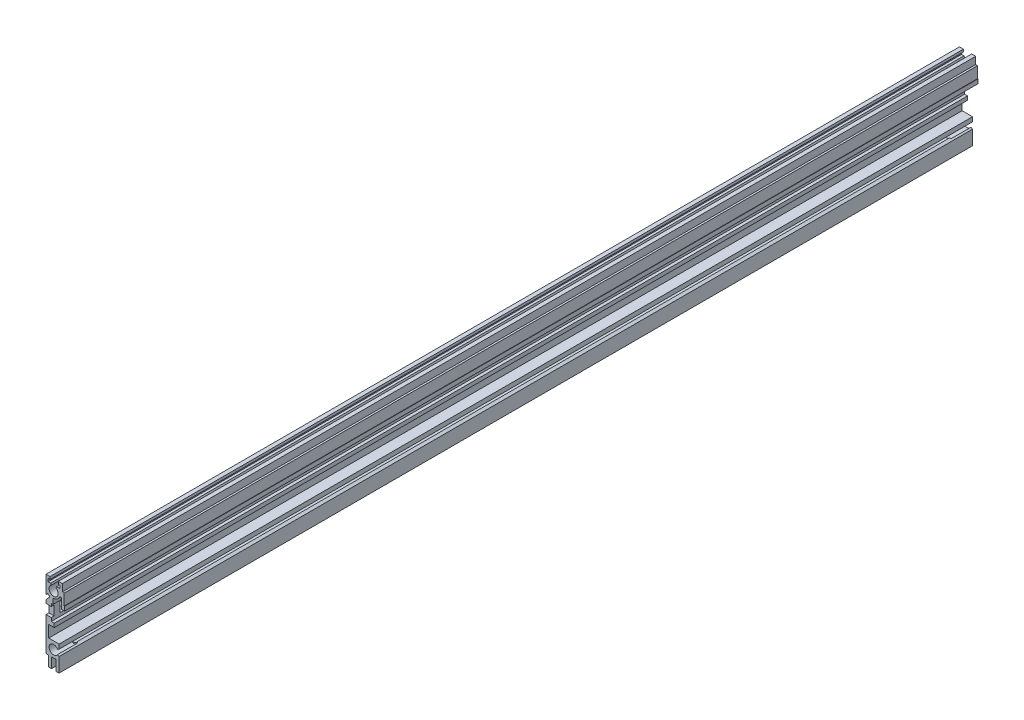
from build123d import *

# Parameters (mm, degrees)
EXTRUDE_1_DEPTH        = 431.8
CUT_EXTRUDE_1_REACH    = 434.825
SKETCH_2_W             = 7.5
SKETCH_2_H             = 4.5
PATTERN_LINEAR_1_COUNT = 43
PATTERN_LINEAR_1_PITCH = 10.16
SKETCH_3_R             = 2.15
CUT_EXTRUDE_2_DEPTH    = 9.5
CUT_EXTRUDE_START      = -9.5
SKETCH_4_R             = 2.15
CUT_EXTRUDE_3_DEPTH    = 9.5
SKETCH_5_W             = 1.36
SKETCH_5_H             = 4.5
CUT_EXTRUDE_4_DEPTH    = 10


with BuildPart() as part:
    # Sketch 1 → Extrude 1 (new body)
    with BuildSketch(Plane.XY):
        with BuildLine():
            Line((-2.5, -8.3), (-1, -8.3))
            Line((-1, -8.3), (-1, -3.4))
            Line((-1, -3.4), (1.1, -3.4))
            Line((1.1, -3.4), (1.1, -8.3))
            Line((1.1, -8.3), (2.6, -8.3))
            Line((2.6, -8.3), (2.6, -1.5011107))
            Line((2.6, -1.5011107), (1.428941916, -0.825))
            ThreePointArc((1.428941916, -0.825), (-1.65, 0), (1.428941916, 0.825))
            Line((1.428941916, 0.825), (2.6, 1.5011107))
            Line((2.6, 1.5011107), (2.6, 3.6))
            Line((2.6, 3.6), (-2.3, 3.6))
            Line((-2.3, 3.6), (-2.3, 9.2))
            Line((-2.3, 9.2), (0.3, 9.2))
            Line((0.3, 9.2), (0.3, 11))
            Line((0.3, 11), (-1.1, 11))
            Line((-1.1, 11), (-1.1, 18.4))
            Line((-1.1, 18.4), (-0.3, 18.4))
            Line((-0.3, 18.4), (-0.3, 20.55580198))
            ThreePointArc((-0.3, 20.55580198), (-0.163656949, 20.898954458), (0.171014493, 21.054961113))
            ThreePointArc((0.171014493, 21.054961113), (1.720972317, 21.604012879), (2.736231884, 22.897486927))
            ThreePointArc((2.736231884, 22.897486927), (3.295173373, 23.201478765), (3.7, 22.710620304))
            Line((3.7, 22.710620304), (3.7, 18.4))
            Line((3.7, 18.4), (5.2, 18.4))
            Line((5.2, 18.4), (5.2, 20.4))
            Line((5.2, 20.4), (5, 20.4))
            Line((5, 20.4), (5, 25.7))
            Line((5, 25.7), (4.1, 25.7))
            Line((4.1, 25.7), (4.1, 29.1))
            Line((4.1, 29.1), (2.2, 29.1))
            Line((2.2, 29.1), (2.2, 27.9))
            Line((2.2, 27.9), (3.1, 27.9))
            Line((3.1, 27.9), (3.1, 26.5))
            Line((3.1, 26.5), (1.443375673, 26.5))
            Line((1.443375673, 26.5), (0.825, 25.428941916))
            ThreePointArc((0.825, 25.428941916), (0, 22.35), (-0.825, 25.428941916))
            Line((-0.825, 25.428941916), (-1.443375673, 26.5))
            Line((-1.443375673, 26.5), (-2.6, 26.5))
            Line((-2.6, 26.5), (-2.6, 27.9))
            Line((-2.6, 27.9), (-1.7, 27.9))
            Line((-1.7, 27.9), (-1.7, 29.1))
            Line((-1.7, 29.1), (-3.6, 29.1))
            Line((-3.6, 29.1), (-3.6, 20.792785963))
            Line((-3.6, 20.792785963), (-2.840611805, 21.636550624))
            Line((-2.840611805, 21.636550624), (-1.8, 20.7))
            Line((-1.8, 20.7), (-3.6, 18.7))
            Line((-3.6, 18.7), (-3.6, -3.4))
            Line((-3.6, -3.4), (-2.5, -3.4))
            Line((-2.5, -3.4), (-2.5, -8.3))
        make_face()
    extrude(amount=-EXTRUDE_1_DEPTH)

    # Sketch 2 → Cut-Extrude 1 (cut, up to next)
    with BuildSketch(Plane(origin=(-1.1, 0, 0), x_dir=(0, 0, -1), z_dir=(1, 0, 0)), mode=Mode.PRIVATE) as cut_extrude_1_sk1:
        with Locations((7.77, 14.85)):
            Rectangle(SKETCH_2_W, SKETCH_2_H)
    cut_extrude_1_tool1 = extrude(cut_extrude_1_sk1.sketch, amount=-CUT_EXTRUDE_1_REACH, mode=Mode.PRIVATE) & part.part
    cut_extrude_1 = cut_extrude_1_tool1.solids().sort_by_distance((-1.1, 14.85, -7.77))[0]
    add(cut_extrude_1, mode=Mode.SUBTRACT)

    # Pattern Linear 1: Cut-Extrude 1 ×43
    with Locations(*[(0, 0, -i * PATTERN_LINEAR_1_PITCH) for i in range(1, PATTERN_LINEAR_1_COUNT)]):
        add(cut_extrude_1, mode=Mode.SUBTRACT)

    # Sketch 3 → Cut-Extrude 2 (cut)
    with BuildSketch(Plane.XY):
        Circle(SKETCH_3_R)
        with Locations((0, 24)):
            Circle(SKETCH_3_R)
    extrude(amount=-CUT_EXTRUDE_2_DEPTH, mode=Mode.SUBTRACT)

    # Sketch 4 → Cut-Extrude 3 (cut)
    with BuildSketch(Plane(origin=(0, 0, -431.8), x_dir=(-1, 0, 0), z_dir=(0, 0, -1)).offset(CUT_EXTRUDE_START)):
        Circle(SKETCH_4_R)
        with Locations((0, 24)):
            Circle(SKETCH_4_R)
    extrude(amount=CUT_EXTRUDE_3_DEPTH, mode=Mode.SUBTRACT)

    # Sketch 5 → Cut-Extrude 4 (cut)
    with BuildSketch(Plane.ZY.offset(3.6)):
        with Locations((-0.68, 14.85)):
            Rectangle(SKETCH_5_W, SKETCH_5_H)
        with Locations((-431.12, 14.85)):
            Rectangle(SKETCH_5_W, SKETCH_5_H)
    extrude(amount=-CUT_EXTRUDE_4_DEPTH, mode=Mode.SUBTRACT)


solid = part.part
